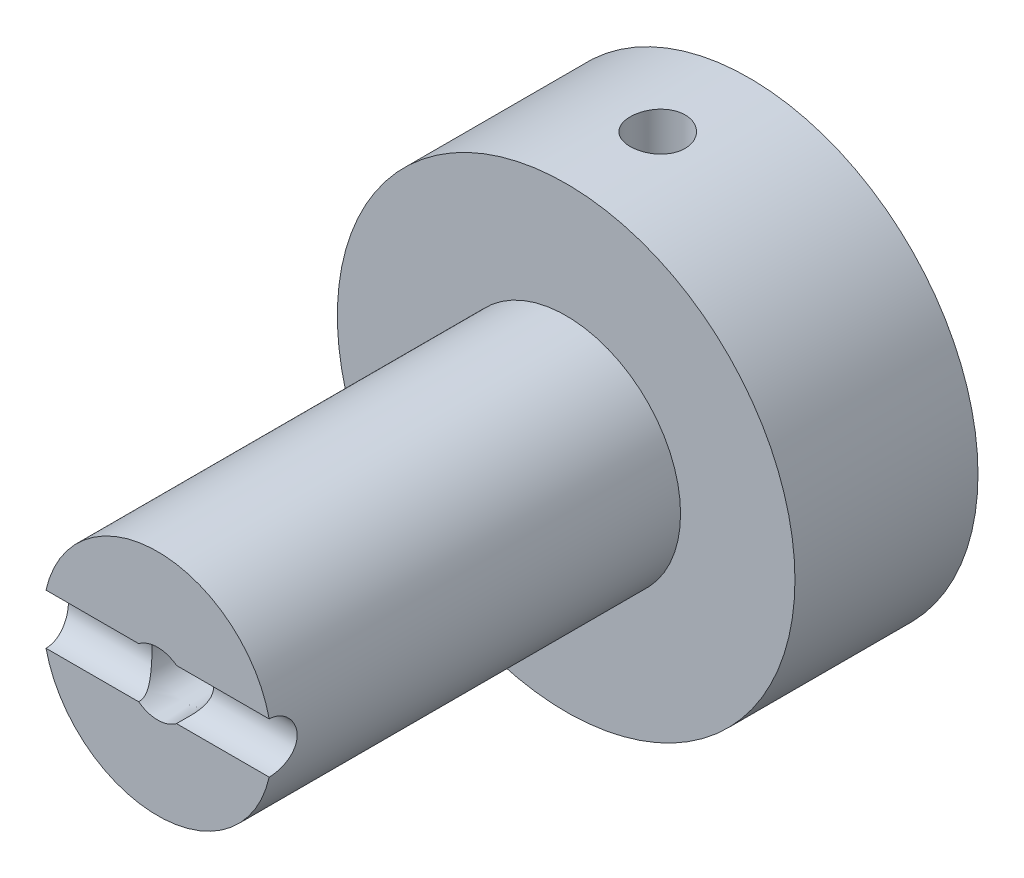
from build123d import *

# Parameters (mm, degrees)
ESQUISSE1_R                         = 25
EXTRUSION1_DEPTH                    = 20
ESQUISSE2_R                         = 12.5
EXTRUSION2_DEPTH                    = 44.64
ESQUISSE3_R                         = 1.75
ENL_V_MAT_EXTRU_1_DEPTH             = 74.677198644
ENL_V_MAT_EXTRU_1_DRAFT             = 1.5
ENL_V_MAT_EXTRU_2_REACH             = 75.677
ENL_V_MAT_EXTRU_2_DIRECTION_2_REACH = 75.677


with BuildPart() as part:
    # Esquisse1 → Extrusion1 (new body)
    with BuildSketch(Plane.XY):
        Circle(ESQUISSE1_R)
    extrude(amount=EXTRUSION1_DEPTH)

    # Esquisse2 → Extrusion2 (add)
    with BuildSketch(Plane.XY.offset(20)):
        Circle(ESQUISSE2_R)
    extrude(amount=EXTRUSION2_DEPTH)


with BuildPart() as enl_v_mat_extru_1_tool:
    # Esquisse3 → Enl_v. mat.-Extru.1 (with draft: the straight prism first)
    with BuildSketch(Plane(origin=(0, 0, 0), x_dir=(-1, 0, 0), z_dir=(0, 0, -1))):
        Circle(ESQUISSE3_R)
    extrude(amount=-ENL_V_MAT_EXTRU_1_DEPTH)
    # Enl_v. mat.-Extru.1: the draft: its side faces are tilted about the plane it starts from
    enl_v_mat_extru_1_sides = [enl_v_mat_extru_1_tool.faces().sort_by_distance(p)[0] for p in [
        (1.75, 0, 37.338599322),
    ]]
    draft(enl_v_mat_extru_1_sides, Plane(origin=(0, 0, 0), x_dir=(-1, 0, 0), z_dir=(0, 0, -1)), ENL_V_MAT_EXTRU_1_DRAFT)


with BuildPart() as part_1:
    add(part.part)

    # Enl_v. mat.-Extru.1: cut by enl_v_mat_extru_1_tool
    add(enl_v_mat_extru_1_tool.part, mode=Mode.SUBTRACT)

    # Esquisse4 → Enl_v. mat.-Extru.2 (cut, up to next)
    with BuildSketch(Plane(origin=(0, 0, 0), x_dir=(0, 0, -1), z_dir=(1, 0, 0)), mode=Mode.PRIVATE) as enl_v_mat_extru_2_sk1:
        with BuildLine():
            Line((-64.64, 2.75), (-64.64, -2.75))
            ThreePointArc((-64.64, -2.75), (-61.89, 0), (-64.64, 2.75))
        make_face()
    enl_v_mat_extru_2_tool1 = extrude(enl_v_mat_extru_2_sk1.sketch, amount=-ENL_V_MAT_EXTRU_2_REACH, mode=Mode.PRIVATE) & part_1.part
    add(enl_v_mat_extru_2_tool1.solids().sort_by_distance((0, 0, 63.472864))[0], mode=Mode.SUBTRACT)

    # Esquisse4 → Enl_v. mat.-Extru.2 direction 2 (cut, up to next)
    with BuildSketch(Plane(origin=(0, 0, 0), x_dir=(0, 0, -1), z_dir=(1, 0, 0)), mode=Mode.PRIVATE) as enl_v_mat_extru_2_direction_2_sk1:
        with BuildLine():
            Line((-64.64, 2.75), (-64.64, -2.75))
            ThreePointArc((-64.64, -2.75), (-61.89, 0), (-64.64, 2.75))
        make_face()
    enl_v_mat_extru_2_direction_2_tool1 = extrude(enl_v_mat_extru_2_direction_2_sk1.sketch, amount=ENL_V_MAT_EXTRU_2_DIRECTION_2_REACH, mode=Mode.PRIVATE) & part_1.part
    add(enl_v_mat_extru_2_direction_2_tool1.solids().sort_by_distance((0, 0, 63.472864))[0], mode=Mode.SUBTRACT)

    # Esquisse5 → Enl_vement de mati_re-R_volution1 (revolve, cut)
    with BuildSketch(Plane(origin=(0, 0, 0), x_dir=(0, 0, -1), z_dir=(1, 0, 0)), mode=Mode.PRIVATE) as enl_vement_de_mati_re_r_volution1_sk:
        Polygon((-10, 25), (-7, 25), (-7, 15), (-10, 12), align=None)
    revolve(enl_vement_de_mati_re_r_volution1_sk.sketch.rotate(Axis((0, 25, 10), (0, -1, 0)), 180), axis=Axis((0, 25, 10), (0, -1, 0)), mode=Mode.SUBTRACT)


solid = part_1.part
